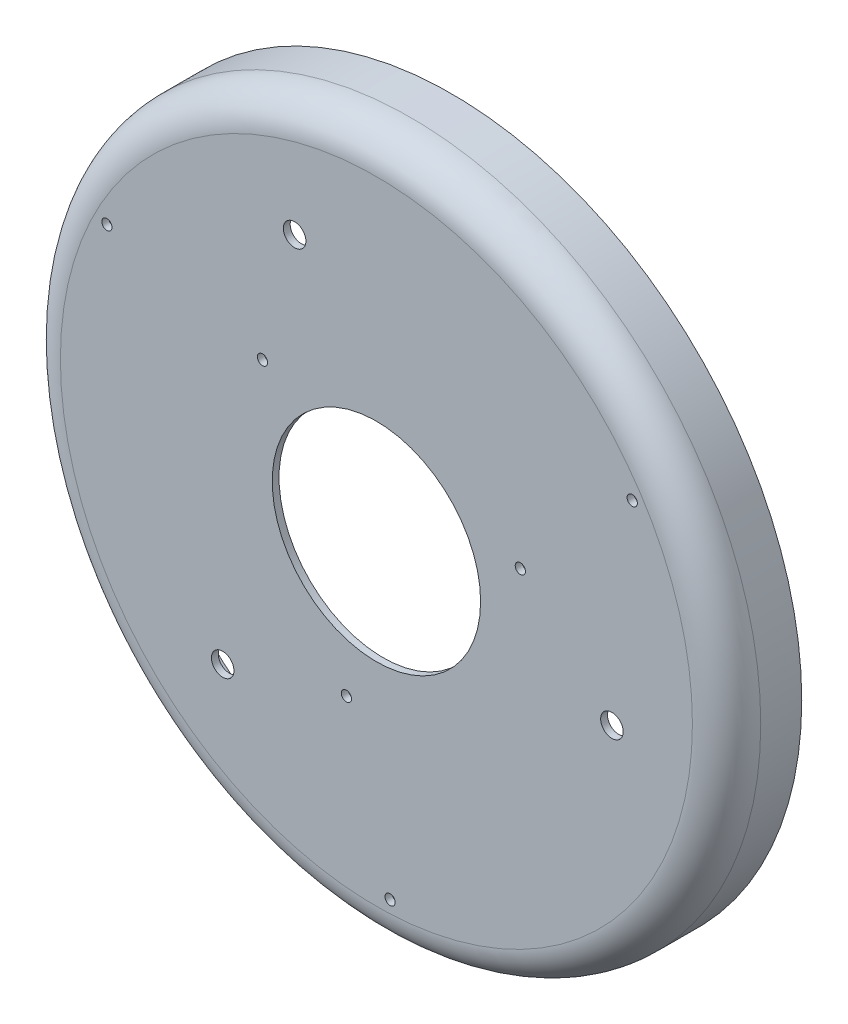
ISO-10303-21;
HEADER;
FILE_DESCRIPTION(('STEP AP214'),'2;1');
FILE_NAME('part.step','',(''),(''),'','','');
FILE_SCHEMA(('AUTOMOTIVE_DESIGN { 1 0 10303 214 1 1 1 1 }'));
ENDSEC;
DATA;
#1=APPLICATION_CONTEXT('core data for automotive mechanical design processes');
#2=APPLICATION_PROTOCOL_DEFINITION('international standard','automotive_design',2000,#1);
#3=PRODUCT_CONTEXT('',#1,'mechanical');
#4=PRODUCT('Part','Part','',(#3));
#5=PRODUCT_RELATED_PRODUCT_CATEGORY('part','',(#4));
#6=PRODUCT_DEFINITION_FORMATION('','',#4);
#7=PRODUCT_DEFINITION_CONTEXT('part definition',#1,'design');
#8=PRODUCT_DEFINITION('design','',#6,#7);
#9=PRODUCT_DEFINITION_SHAPE('','',#8);
#10=(LENGTH_UNIT() NAMED_UNIT(*) SI_UNIT(.MILLI.,.METRE.));
#11=(NAMED_UNIT(*) PLANE_ANGLE_UNIT() SI_UNIT($,.RADIAN.));
#12=(NAMED_UNIT(*) SI_UNIT($,.STERADIAN.) SOLID_ANGLE_UNIT());
#13=UNCERTAINTY_MEASURE_WITH_UNIT(LENGTH_MEASURE(1.E-05),#10,'distance_accuracy_value','');
#14=(GEOMETRIC_REPRESENTATION_CONTEXT(3) GLOBAL_UNCERTAINTY_ASSIGNED_CONTEXT((#13)) GLOBAL_UNIT_ASSIGNED_CONTEXT((#10,
#11,#12)) REPRESENTATION_CONTEXT('',''));
#15=CARTESIAN_POINT('',(0.,0.,0.));
#16=DIRECTION('',(0.,0.,1.));
#17=DIRECTION('',(1.,0.,0.));
#18=AXIS2_PLACEMENT_3D('',#15,#16,#17);
#19=CARTESIAN_POINT('',(0.,0.,0.));
#20=DIRECTION('',(0.,0.,1.));
#21=DIRECTION('',(1.,0.,0.));
#22=AXIS2_PLACEMENT_3D('',#19,#20,#21);
#23=CYLINDRICAL_SURFACE('',#22,102.5);
#24=CARTESIAN_POINT('',(0.,0.,20.));
#25=DIRECTION('',(0.,0.,1.));
#26=DIRECTION('',(1.,0.,0.));
#27=AXIS2_PLACEMENT_3D('',#24,#25,#26);
#28=CIRCLE('',#27,102.5);
#29=CARTESIAN_POINT('',(102.5,0.,20.));
#30=VERTEX_POINT('',#29);
#31=EDGE_CURVE('E11',#30,#30,#28,.F.);
#32=ORIENTED_EDGE('',*,*,#31,.T.);
#33=EDGE_LOOP('',(#32));
#34=FACE_BOUND('',#33,.T.);
#35=CARTESIAN_POINT('',(0.,0.,8.));
#36=DIRECTION('',(0.,0.,-1.));
#37=DIRECTION('',(-1.,0.,0.));
#38=AXIS2_PLACEMENT_3D('',#35,#36,#37);
#39=CIRCLE('',#38,102.5);
#40=CARTESIAN_POINT('',(-102.5,0.,8.));
#41=VERTEX_POINT('',#40);
#42=EDGE_CURVE('E90',#41,#41,#39,.F.);
#43=ORIENTED_EDGE('',*,*,#42,.T.);
#44=EDGE_LOOP('',(#43));
#45=FACE_BOUND('',#44,.T.);
#46=ADVANCED_FACE('F37',(#34,#45),#23,.T.);
#47=CARTESIAN_POINT('',(0.,0.,0.));
#48=DIRECTION('',(0.,0.,1.));
#49=DIRECTION('',(1.,0.,0.));
#50=AXIS2_PLACEMENT_3D('',#47,#48,#49);
#51=CYLINDRICAL_SURFACE('',#50,100.5);
#52=CARTESIAN_POINT('',(0.,0.,20.));
#53=DIRECTION('',(0.,0.,1.));
#54=DIRECTION('',(1.,0.,0.));
#55=AXIS2_PLACEMENT_3D('',#52,#53,#54);
#56=CIRCLE('',#55,100.5);
#57=CARTESIAN_POINT('',(100.5,0.,20.));
#58=VERTEX_POINT('',#57);
#59=EDGE_CURVE('E118',#58,#58,#56,.F.);
#60=ORIENTED_EDGE('',*,*,#59,.F.);
#61=EDGE_LOOP('',(#60));
#62=FACE_BOUND('',#61,.T.);
#63=CARTESIAN_POINT('',(0.,0.,8.));
#64=DIRECTION('',(0.,0.,-1.));
#65=DIRECTION('',(-1.,0.,0.));
#66=AXIS2_PLACEMENT_3D('',#63,#64,#65);
#67=CIRCLE('',#66,100.5);
#68=CARTESIAN_POINT('',(-100.5,0.,8.));
#69=VERTEX_POINT('',#68);
#70=EDGE_CURVE('E41',#69,#69,#67,.F.);
#71=ORIENTED_EDGE('',*,*,#70,.F.);
#72=EDGE_LOOP('',(#71));
#73=FACE_BOUND('',#72,.T.);
#74=ADVANCED_FACE('F129',(#62,#73),#51,.F.);
#75=CARTESIAN_POINT('',(0.,0.,30.));
#76=DIRECTION('',(0.,0.,1.));
#77=DIRECTION('',(1.,0.,0.));
#78=AXIS2_PLACEMENT_3D('',#75,#76,#77);
#79=PLANE('',#78);
#80=CARTESIAN_POINT('',(42.1299416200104,14.1826232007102,30.));
#81=DIRECTION('',(0.,0.,1.));
#82=DIRECTION('',(-0.499999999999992,-0.866025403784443,0.));
#83=AXIS2_PLACEMENT_3D('',#80,#81,#82);
#84=CIRCLE('',#83,1.50000000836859);
#85=CARTESIAN_POINT('',(41.3799416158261,12.8835850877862,30.));
#86=VERTEX_POINT('',#85);
#87=EDGE_CURVE('E84',#86,#86,#84,.T.);
#88=ORIENTED_EDGE('',*,*,#87,.F.);
#89=EDGE_LOOP('',(#88));
#90=FACE_BOUND('',#89,.T.);
#91=CARTESIAN_POINT('',(-8.78245882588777,-43.5769113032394,30.));
#92=DIRECTION('',(0.,0.,1.));
#93=DIRECTION('',(-0.500000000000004,0.866025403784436,0.));
#94=AXIS2_PLACEMENT_3D('',#91,#92,#93);
#95=CIRCLE('',#94,1.50000000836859);
#96=CARTESIAN_POINT('',(-9.53245883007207,-42.2778731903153,30.));
#97=VERTEX_POINT('',#96);
#98=EDGE_CURVE('E81',#97,#97,#95,.T.);
#99=ORIENTED_EDGE('',*,*,#98,.F.);
#100=EDGE_LOOP('',(#99));
#101=FACE_BOUND('',#100,.T.);
#102=CARTESIAN_POINT('',(-33.3474827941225,29.3942881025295,30.));
#103=DIRECTION('',(0.,0.,1.));
#104=DIRECTION('',(1.,0.,0.));
#105=AXIS2_PLACEMENT_3D('',#102,#103,#104);
#106=CIRCLE('',#105,1.50000000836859);
#107=CARTESIAN_POINT('',(-31.847482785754,29.3942881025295,30.));
#108=VERTEX_POINT('',#107);
#109=EDGE_CURVE('E78',#108,#108,#106,.T.);
#110=ORIENTED_EDGE('',*,*,#109,.F.);
#111=EDGE_LOOP('',(#110));
#112=FACE_BOUND('',#111,.T.);
#113=CARTESIAN_POINT('',(4.00666365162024,-88.7723293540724,30.));
#114=DIRECTION('',(0.,0.,1.));
#115=DIRECTION('',(-0.499999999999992,-0.866025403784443,0.));
#116=AXIS2_PLACEMENT_3D('',#113,#114,#115);
#117=CIRCLE('',#116,1.5);
#118=CARTESIAN_POINT('',(3.25666365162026,-90.071367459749,30.));
#119=VERTEX_POINT('',#118);
#120=EDGE_CURVE('E74',#119,#119,#117,.T.);
#121=ORIENTED_EDGE('',*,*,#120,.F.);
#122=EDGE_LOOP('',(#121));
#123=FACE_BOUND('',#122,.T.);
#124=CARTESIAN_POINT('',(-78.8824241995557,40.9162921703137,30.));
#125=DIRECTION('',(0.,0.,1.));
#126=DIRECTION('',(-0.500000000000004,0.866025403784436,0.));
#127=AXIS2_PLACEMENT_3D('',#124,#125,#126);
#128=CIRCLE('',#127,1.5);
#129=CARTESIAN_POINT('',(-79.6324241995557,42.2153302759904,30.));
#130=VERTEX_POINT('',#129);
#131=EDGE_CURVE('E70',#130,#130,#128,.T.);
#132=ORIENTED_EDGE('',*,*,#131,.F.);
#133=EDGE_LOOP('',(#132));
#134=FACE_BOUND('',#133,.T.);
#135=CARTESIAN_POINT('',(74.875760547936,47.8560371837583,30.));
#136=DIRECTION('',(0.,0.,1.));
#137=DIRECTION('',(1.,0.,0.));
#138=AXIS2_PLACEMENT_3D('',#135,#136,#137);
#139=CIRCLE('',#138,1.5);
#140=CARTESIAN_POINT('',(76.375760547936,47.8560371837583,30.));
#141=VERTEX_POINT('',#140);
#142=EDGE_CURVE('E66',#141,#141,#139,.T.);
#143=ORIENTED_EDGE('',*,*,#142,.F.);
#144=EDGE_LOOP('',(#143));
#145=FACE_BOUND('',#144,.T.);
#146=CARTESIAN_POINT('',(-44.9951326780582,-53.6231110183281,30.));
#147=DIRECTION('',(0.,0.,1.));
#148=DIRECTION('',(1.,0.,0.));
#149=AXIS2_PLACEMENT_3D('',#146,#147,#148);
#150=CIRCLE('',#149,3.29999999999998);
#151=CARTESIAN_POINT('',(-41.6951326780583,-53.6231110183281,30.));
#152=VERTEX_POINT('',#151);
#153=EDGE_CURVE('E62',#152,#152,#150,.T.);
#154=ORIENTED_EDGE('',*,*,#153,.F.);
#155=EDGE_LOOP('',(#154));
#156=FACE_BOUND('',#155,.T.);
#157=CARTESIAN_POINT('',(-23.9414100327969,65.7784834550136,30.));
#158=DIRECTION('',(0.,0.,1.));
#159=DIRECTION('',(1.,0.,0.));
#160=AXIS2_PLACEMENT_3D('',#157,#158,#159);
#161=CIRCLE('',#160,3.29999999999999);
#162=CARTESIAN_POINT('',(-20.6414100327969,65.7784834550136,30.));
#163=VERTEX_POINT('',#162);
#164=EDGE_CURVE('E58',#163,#163,#161,.T.);
#165=ORIENTED_EDGE('',*,*,#164,.F.);
#166=EDGE_LOOP('',(#165));
#167=FACE_BOUND('',#166,.T.);
#168=CARTESIAN_POINT('',(68.9365427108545,-12.1553724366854,30.));
#169=DIRECTION('',(0.,0.,1.));
#170=DIRECTION('',(1.,0.,0.));
#171=AXIS2_PLACEMENT_3D('',#168,#169,#170);
#172=CIRCLE('',#171,3.29999999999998);
#173=CARTESIAN_POINT('',(72.2365427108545,-12.1553724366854,30.));
#174=VERTEX_POINT('',#173);
#175=EDGE_CURVE('E57',#174,#174,#172,.T.);
#176=ORIENTED_EDGE('',*,*,#175,.F.);
#177=EDGE_LOOP('',(#176));
#178=FACE_BOUND('',#177,.T.);
#179=CARTESIAN_POINT('',(0.,0.,30.));
#180=DIRECTION('',(0.,0.,1.));
#181=DIRECTION('',(1.,0.,0.));
#182=AXIS2_PLACEMENT_3D('',#179,#180,#181);
#183=CIRCLE('',#182,92.5);
#184=CARTESIAN_POINT('',(92.5,0.,30.));
#185=VERTEX_POINT('',#184);
#186=EDGE_CURVE('E45',#185,#185,#183,.T.);
#187=ORIENTED_EDGE('',*,*,#186,.T.);
#188=EDGE_LOOP('',(#187));
#189=FACE_BOUND('',#188,.T.);
#190=CARTESIAN_POINT('',(0.,0.,30.));
#191=DIRECTION('',(0.,0.,1.));
#192=DIRECTION('',(1.,0.,0.));
#193=AXIS2_PLACEMENT_3D('',#190,#191,#192);
#194=CIRCLE('',#193,30.5);
#195=CARTESIAN_POINT('',(30.5,0.,30.));
#196=VERTEX_POINT('',#195);
#197=EDGE_CURVE('E50',#196,#196,#194,.T.);
#198=ORIENTED_EDGE('',*,*,#197,.F.);
#199=EDGE_LOOP('',(#198));
#200=FACE_BOUND('',#199,.T.);
#201=ADVANCED_FACE('F127',(#90,#101,#112,#123,#134,#145,#156,#167,#178,#189,#200),#79,.T.);
#202=CARTESIAN_POINT('',(0.,0.,0.));
#203=DIRECTION('',(0.,0.,1.));
#204=DIRECTION('',(1.,0.,0.));
#205=AXIS2_PLACEMENT_3D('',#202,#203,#204);
#206=CYLINDRICAL_SURFACE('',#205,30.5);
#207=CARTESIAN_POINT('',(0.,0.,28.));
#208=DIRECTION('',(0.,0.,1.));
#209=DIRECTION('',(1.,0.,0.));
#210=AXIS2_PLACEMENT_3D('',#207,#208,#209);
#211=CIRCLE('',#210,30.5);
#212=CARTESIAN_POINT('',(30.5,0.,28.));
#213=VERTEX_POINT('',#212);
#214=EDGE_CURVE('E114',#213,#213,#211,.F.);
#215=ORIENTED_EDGE('',*,*,#214,.T.);
#216=EDGE_LOOP('',(#215));
#217=FACE_BOUND('',#216,.T.);
#218=ORIENTED_EDGE('',*,*,#197,.T.);
#219=EDGE_LOOP('',(#218));
#220=FACE_BOUND('',#219,.T.);
#221=ADVANCED_FACE('F125',(#217,#220),#206,.F.);
#222=CARTESIAN_POINT('',(0.,0.,20.));
#223=DIRECTION('',(0.,0.,1.));
#224=DIRECTION('',(1.,0.,0.));
#225=AXIS2_PLACEMENT_3D('',#222,#223,#224);
#226=TOROIDAL_SURFACE('',#225,92.5,10.);
#227=ORIENTED_EDGE('',*,*,#31,.F.);
#228=EDGE_LOOP('',(#227));
#229=FACE_BOUND('',#228,.T.);
#230=ORIENTED_EDGE('',*,*,#186,.F.);
#231=EDGE_LOOP('',(#230));
#232=FACE_BOUND('',#231,.T.);
#233=ADVANCED_FACE('F39',(#229,#232),#226,.T.);
#234=CARTESIAN_POINT('',(0.,0.,28.));
#235=DIRECTION('',(0.,0.,1.));
#236=DIRECTION('',(1.,0.,0.));
#237=AXIS2_PLACEMENT_3D('',#234,#235,#236);
#238=PLANE('',#237);
#239=CARTESIAN_POINT('',(42.1299416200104,14.1826232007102,28.));
#240=DIRECTION('',(0.,0.,1.));
#241=DIRECTION('',(1.,0.,0.));
#242=AXIS2_PLACEMENT_3D('',#239,#240,#241);
#243=CIRCLE('',#242,1.50000000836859);
#244=CARTESIAN_POINT('',(43.629941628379,14.1826232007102,28.));
#245=VERTEX_POINT('',#244);
#246=EDGE_CURVE('E82',#245,#245,#243,.T.);
#247=ORIENTED_EDGE('',*,*,#246,.T.);
#248=EDGE_LOOP('',(#247));
#249=FACE_BOUND('',#248,.T.);
#250=CARTESIAN_POINT('',(-8.78245882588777,-43.5769113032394,28.));
#251=DIRECTION('',(0.,0.,1.));
#252=DIRECTION('',(1.,0.,0.));
#253=AXIS2_PLACEMENT_3D('',#250,#251,#252);
#254=CIRCLE('',#253,1.50000000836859);
#255=CARTESIAN_POINT('',(-7.28245881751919,-43.5769113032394,28.));
#256=VERTEX_POINT('',#255);
#257=EDGE_CURVE('E79',#256,#256,#254,.T.);
#258=ORIENTED_EDGE('',*,*,#257,.T.);
#259=EDGE_LOOP('',(#258));
#260=FACE_BOUND('',#259,.T.);
#261=CARTESIAN_POINT('',(-33.3474827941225,29.3942881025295,28.));
#262=DIRECTION('',(0.,0.,1.));
#263=DIRECTION('',(1.,0.,0.));
#264=AXIS2_PLACEMENT_3D('',#261,#262,#263);
#265=CIRCLE('',#264,1.50000000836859);
#266=CARTESIAN_POINT('',(-31.847482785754,29.3942881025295,28.));
#267=VERTEX_POINT('',#266);
#268=EDGE_CURVE('E75',#267,#267,#265,.T.);
#269=ORIENTED_EDGE('',*,*,#268,.T.);
#270=EDGE_LOOP('',(#269));
#271=FACE_BOUND('',#270,.T.);
#272=CARTESIAN_POINT('',(4.00666365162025,-88.7723293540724,28.));
#273=DIRECTION('',(0.,0.,1.));
#274=DIRECTION('',(1.,0.,0.));
#275=AXIS2_PLACEMENT_3D('',#272,#273,#274);
#276=CIRCLE('',#275,1.5);
#277=CARTESIAN_POINT('',(5.50666365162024,-88.7723293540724,28.));
#278=VERTEX_POINT('',#277);
#279=EDGE_CURVE('E71',#278,#278,#276,.T.);
#280=ORIENTED_EDGE('',*,*,#279,.T.);
#281=EDGE_LOOP('',(#280));
#282=FACE_BOUND('',#281,.T.);
#283=CARTESIAN_POINT('',(-78.8824241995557,40.9162921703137,28.));
#284=DIRECTION('',(0.,0.,1.));
#285=DIRECTION('',(1.,0.,0.));
#286=AXIS2_PLACEMENT_3D('',#283,#284,#285);
#287=CIRCLE('',#286,1.5);
#288=CARTESIAN_POINT('',(-77.3824241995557,40.9162921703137,28.));
#289=VERTEX_POINT('',#288);
#290=EDGE_CURVE('E67',#289,#289,#287,.T.);
#291=ORIENTED_EDGE('',*,*,#290,.T.);
#292=EDGE_LOOP('',(#291));
#293=FACE_BOUND('',#292,.T.);
#294=CARTESIAN_POINT('',(74.875760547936,47.8560371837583,28.));
#295=DIRECTION('',(0.,0.,1.));
#296=DIRECTION('',(1.,0.,0.));
#297=AXIS2_PLACEMENT_3D('',#294,#295,#296);
#298=CIRCLE('',#297,1.5);
#299=CARTESIAN_POINT('',(76.375760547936,47.8560371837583,28.));
#300=VERTEX_POINT('',#299);
#301=EDGE_CURVE('E63',#300,#300,#298,.T.);
#302=ORIENTED_EDGE('',*,*,#301,.T.);
#303=EDGE_LOOP('',(#302));
#304=FACE_BOUND('',#303,.T.);
#305=CARTESIAN_POINT('',(-44.9951326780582,-53.6231110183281,28.));
#306=DIRECTION('',(0.,0.,1.));
#307=DIRECTION('',(1.,0.,0.));
#308=AXIS2_PLACEMENT_3D('',#305,#306,#307);
#309=CIRCLE('',#308,3.29999999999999);
#310=CARTESIAN_POINT('',(-41.6951326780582,-53.6231110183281,28.));
#311=VERTEX_POINT('',#310);
#312=EDGE_CURVE('E59',#311,#311,#309,.T.);
#313=ORIENTED_EDGE('',*,*,#312,.T.);
#314=EDGE_LOOP('',(#313));
#315=FACE_BOUND('',#314,.T.);
#316=CARTESIAN_POINT('',(-23.9414100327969,65.7784834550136,28.));
#317=DIRECTION('',(0.,0.,1.));
#318=DIRECTION('',(1.,0.,0.));
#319=AXIS2_PLACEMENT_3D('',#316,#317,#318);
#320=CIRCLE('',#319,3.29999999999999);
#321=CARTESIAN_POINT('',(-20.6414100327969,65.7784834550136,28.));
#322=VERTEX_POINT('',#321);
#323=EDGE_CURVE('E54',#322,#322,#320,.T.);
#324=ORIENTED_EDGE('',*,*,#323,.T.);
#325=EDGE_LOOP('',(#324));
#326=FACE_BOUND('',#325,.T.);
#327=CARTESIAN_POINT('',(68.9365427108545,-12.1553724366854,28.));
#328=DIRECTION('',(0.,0.,1.));
#329=DIRECTION('',(1.,0.,0.));
#330=AXIS2_PLACEMENT_3D('',#327,#328,#329);
#331=CIRCLE('',#330,3.29999999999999);
#332=CARTESIAN_POINT('',(72.2365427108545,-12.1553724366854,28.));
#333=VERTEX_POINT('',#332);
#334=EDGE_CURVE('E111',#333,#333,#331,.T.);
#335=ORIENTED_EDGE('',*,*,#334,.T.);
#336=EDGE_LOOP('',(#335));
#337=FACE_BOUND('',#336,.T.);
#338=CARTESIAN_POINT('',(0.,0.,28.));
#339=DIRECTION('',(0.,0.,1.));
#340=DIRECTION('',(1.,0.,0.));
#341=AXIS2_PLACEMENT_3D('',#338,#339,#340);
#342=CIRCLE('',#341,92.5);
#343=CARTESIAN_POINT('',(92.5,0.,28.));
#344=VERTEX_POINT('',#343);
#345=EDGE_CURVE('E117',#344,#344,#342,.T.);
#346=ORIENTED_EDGE('',*,*,#345,.F.);
#347=EDGE_LOOP('',(#346));
#348=FACE_BOUND('',#347,.T.);
#349=ORIENTED_EDGE('',*,*,#214,.F.);
#350=EDGE_LOOP('',(#349));
#351=FACE_BOUND('',#350,.T.);
#352=ADVANCED_FACE('F150',(#249,#260,#271,#282,#293,#304,#315,#326,#337,#348,#351),#238,.F.);
#353=CARTESIAN_POINT('',(0.,0.,20.));
#354=DIRECTION('',(0.,0.,1.));
#355=DIRECTION('',(1.,0.,0.));
#356=AXIS2_PLACEMENT_3D('',#353,#354,#355);
#357=TOROIDAL_SURFACE('',#356,92.5,8.);
#358=ORIENTED_EDGE('',*,*,#59,.T.);
#359=EDGE_LOOP('',(#358));
#360=FACE_BOUND('',#359,.T.);
#361=ORIENTED_EDGE('',*,*,#345,.T.);
#362=EDGE_LOOP('',(#361));
#363=FACE_BOUND('',#362,.T.);
#364=ADVANCED_FACE('F146',(#360,#363),#357,.F.);
#365=CARTESIAN_POINT('',(68.9365427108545,-12.1553724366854,30.));
#366=DIRECTION('',(0.,0.,1.));
#367=DIRECTION('',(1.,0.,0.));
#368=AXIS2_PLACEMENT_3D('',#365,#366,#367);
#369=CYLINDRICAL_SURFACE('',#368,3.29999999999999);
#370=ORIENTED_EDGE('',*,*,#175,.T.);
#371=EDGE_LOOP('',(#370));
#372=FACE_BOUND('',#371,.T.);
#373=ORIENTED_EDGE('',*,*,#334,.F.);
#374=EDGE_LOOP('',(#373));
#375=FACE_BOUND('',#374,.T.);
#376=ADVANCED_FACE('F149',(#372,#375),#369,.F.);
#377=CARTESIAN_POINT('',(-23.9414100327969,65.7784834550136,30.));
#378=DIRECTION('',(0.,0.,1.));
#379=DIRECTION('',(1.,0.,0.));
#380=AXIS2_PLACEMENT_3D('',#377,#378,#379);
#381=CYLINDRICAL_SURFACE('',#380,3.29999999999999);
#382=ORIENTED_EDGE('',*,*,#164,.T.);
#383=EDGE_LOOP('',(#382));
#384=FACE_BOUND('',#383,.T.);
#385=ORIENTED_EDGE('',*,*,#323,.F.);
#386=EDGE_LOOP('',(#385));
#387=FACE_BOUND('',#386,.T.);
#388=ADVANCED_FACE('F156',(#384,#387),#381,.F.);
#389=CARTESIAN_POINT('',(-44.9951326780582,-53.6231110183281,30.));
#390=DIRECTION('',(0.,0.,1.));
#391=DIRECTION('',(1.,0.,0.));
#392=AXIS2_PLACEMENT_3D('',#389,#390,#391);
#393=CYLINDRICAL_SURFACE('',#392,3.29999999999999);
#394=ORIENTED_EDGE('',*,*,#153,.T.);
#395=EDGE_LOOP('',(#394));
#396=FACE_BOUND('',#395,.T.);
#397=ORIENTED_EDGE('',*,*,#312,.F.);
#398=EDGE_LOOP('',(#397));
#399=FACE_BOUND('',#398,.T.);
#400=ADVANCED_FACE('F160',(#396,#399),#393,.F.);
#401=CARTESIAN_POINT('',(74.875760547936,47.8560371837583,27.));
#402=DIRECTION('',(0.,0.,1.));
#403=DIRECTION('',(1.,0.,0.));
#404=AXIS2_PLACEMENT_3D('',#401,#402,#403);
#405=CYLINDRICAL_SURFACE('',#404,1.5);
#406=ORIENTED_EDGE('',*,*,#142,.T.);
#407=EDGE_LOOP('',(#406));
#408=FACE_BOUND('',#407,.T.);
#409=ORIENTED_EDGE('',*,*,#301,.F.);
#410=EDGE_LOOP('',(#409));
#411=FACE_BOUND('',#410,.T.);
#412=ADVANCED_FACE('F164',(#408,#411),#405,.F.);
#413=CARTESIAN_POINT('',(-78.8824241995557,40.9162921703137,27.));
#414=DIRECTION('',(0.,0.,1.));
#415=DIRECTION('',(1.,0.,0.));
#416=AXIS2_PLACEMENT_3D('',#413,#414,#415);
#417=CYLINDRICAL_SURFACE('',#416,1.5);
#418=ORIENTED_EDGE('',*,*,#131,.T.);
#419=EDGE_LOOP('',(#418));
#420=FACE_BOUND('',#419,.T.);
#421=ORIENTED_EDGE('',*,*,#290,.F.);
#422=EDGE_LOOP('',(#421));
#423=FACE_BOUND('',#422,.T.);
#424=ADVANCED_FACE('F168',(#420,#423),#417,.F.);
#425=CARTESIAN_POINT('',(4.00666365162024,-88.7723293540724,27.));
#426=DIRECTION('',(0.,0.,1.));
#427=DIRECTION('',(1.,0.,0.));
#428=AXIS2_PLACEMENT_3D('',#425,#426,#427);
#429=CYLINDRICAL_SURFACE('',#428,1.5);
#430=ORIENTED_EDGE('',*,*,#120,.T.);
#431=EDGE_LOOP('',(#430));
#432=FACE_BOUND('',#431,.T.);
#433=ORIENTED_EDGE('',*,*,#279,.F.);
#434=EDGE_LOOP('',(#433));
#435=FACE_BOUND('',#434,.T.);
#436=ADVANCED_FACE('F172',(#432,#435),#429,.F.);
#437=CARTESIAN_POINT('',(-33.3474827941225,29.3942881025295,27.));
#438=DIRECTION('',(0.,0.,1.));
#439=DIRECTION('',(1.,0.,0.));
#440=AXIS2_PLACEMENT_3D('',#437,#438,#439);
#441=CYLINDRICAL_SURFACE('',#440,1.50000000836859);
#442=ORIENTED_EDGE('',*,*,#109,.T.);
#443=EDGE_LOOP('',(#442));
#444=FACE_BOUND('',#443,.T.);
#445=ORIENTED_EDGE('',*,*,#268,.F.);
#446=EDGE_LOOP('',(#445));
#447=FACE_BOUND('',#446,.T.);
#448=ADVANCED_FACE('F176',(#444,#447),#441,.F.);
#449=CARTESIAN_POINT('',(-8.78245882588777,-43.5769113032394,27.));
#450=DIRECTION('',(0.,0.,1.));
#451=DIRECTION('',(1.,0.,0.));
#452=AXIS2_PLACEMENT_3D('',#449,#450,#451);
#453=CYLINDRICAL_SURFACE('',#452,1.50000000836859);
#454=ORIENTED_EDGE('',*,*,#98,.T.);
#455=EDGE_LOOP('',(#454));
#456=FACE_BOUND('',#455,.T.);
#457=ORIENTED_EDGE('',*,*,#257,.F.);
#458=EDGE_LOOP('',(#457));
#459=FACE_BOUND('',#458,.T.);
#460=ADVANCED_FACE('F180',(#456,#459),#453,.F.);
#461=CARTESIAN_POINT('',(42.1299416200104,14.1826232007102,27.));
#462=DIRECTION('',(0.,0.,1.));
#463=DIRECTION('',(1.,0.,0.));
#464=AXIS2_PLACEMENT_3D('',#461,#462,#463);
#465=CYLINDRICAL_SURFACE('',#464,1.50000000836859);
#466=ORIENTED_EDGE('',*,*,#87,.T.);
#467=EDGE_LOOP('',(#466));
#468=FACE_BOUND('',#467,.T.);
#469=ORIENTED_EDGE('',*,*,#246,.F.);
#470=EDGE_LOOP('',(#469));
#471=FACE_BOUND('',#470,.T.);
#472=ADVANCED_FACE('F184',(#468,#471),#465,.F.);
#473=CARTESIAN_POINT('',(-254.178572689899,226.104233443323,8.00000000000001));
#474=DIRECTION('',(0.,0.,-1.));
#475=DIRECTION('',(-1.,0.,0.));
#476=AXIS2_PLACEMENT_3D('',#473,#474,#475);
#477=PLANE('',#476);
#478=ORIENTED_EDGE('',*,*,#42,.F.);
#479=EDGE_LOOP('',(#478));
#480=FACE_BOUND('',#479,.T.);
#481=ORIENTED_EDGE('',*,*,#70,.T.);
#482=EDGE_LOOP('',(#481));
#483=FACE_BOUND('',#482,.T.);
#484=ADVANCED_FACE('F188',(#480,#483),#477,.T.);
#485=CLOSED_SHELL('',(#46,#74,#201,#221,#233,#352,#364,#376,#388,#400,#412,#424,#436,#448,#460,
#472,#484));
#486=MANIFOLD_SOLID_BREP('B2',#485);
#487=ADVANCED_BREP_SHAPE_REPRESENTATION('',(#18,#486),#14);
#488=SHAPE_DEFINITION_REPRESENTATION(#9,#487);
ENDSEC;
END-ISO-10303-21;
